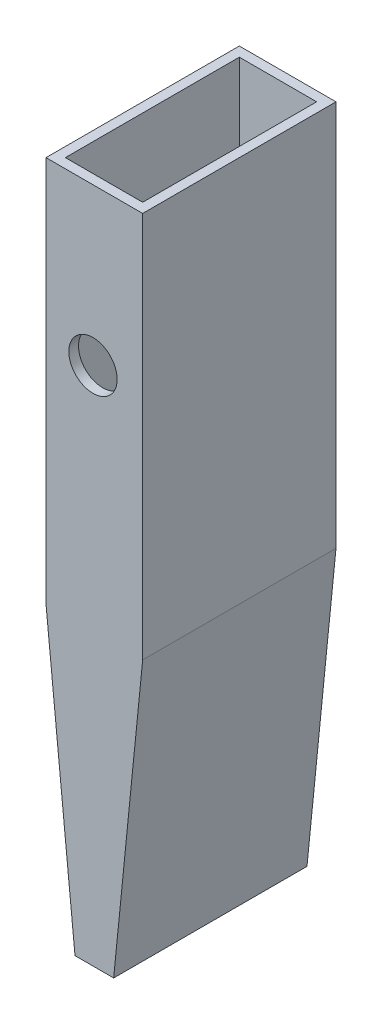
from build123d import *

# Parameters (mm, degrees)
EXTRUDE_1_DEPTH     = 20
SHELL_1_T           = -1
SKETCH_3_R          = 2.5
CUT_EXTRUDE_2_DEPTH = 20


with BuildPart() as part:
    # Sketch 1 → Extrude 1 (new body)
    with BuildSketch(Plane.XY):
        Polygon((-5, 20), (5, 20), (5, -20), (2, -50), (-2, -50), (-5, -20), align=None)
    extrude(amount=EXTRUDE_1_DEPTH)

    # Shell 1
    shell_1_openings = [part.faces().sort_by_distance(p)[0] for p in [
        (0, -50, 10),
        (0, 20, 10),
    ]]
    offset(amount=SHELL_1_T, openings=shell_1_openings, kind=Kind.INTERSECTION)

    # Sketch 3 → Cut-Extrude 2 (cut)
    with BuildSketch(Plane.XY.offset(20)):
        with Locations((-0.138164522, 3.809929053)):
            Circle(SKETCH_3_R)
    extrude(amount=-CUT_EXTRUDE_2_DEPTH, mode=Mode.SUBTRACT)


solid = part.part
